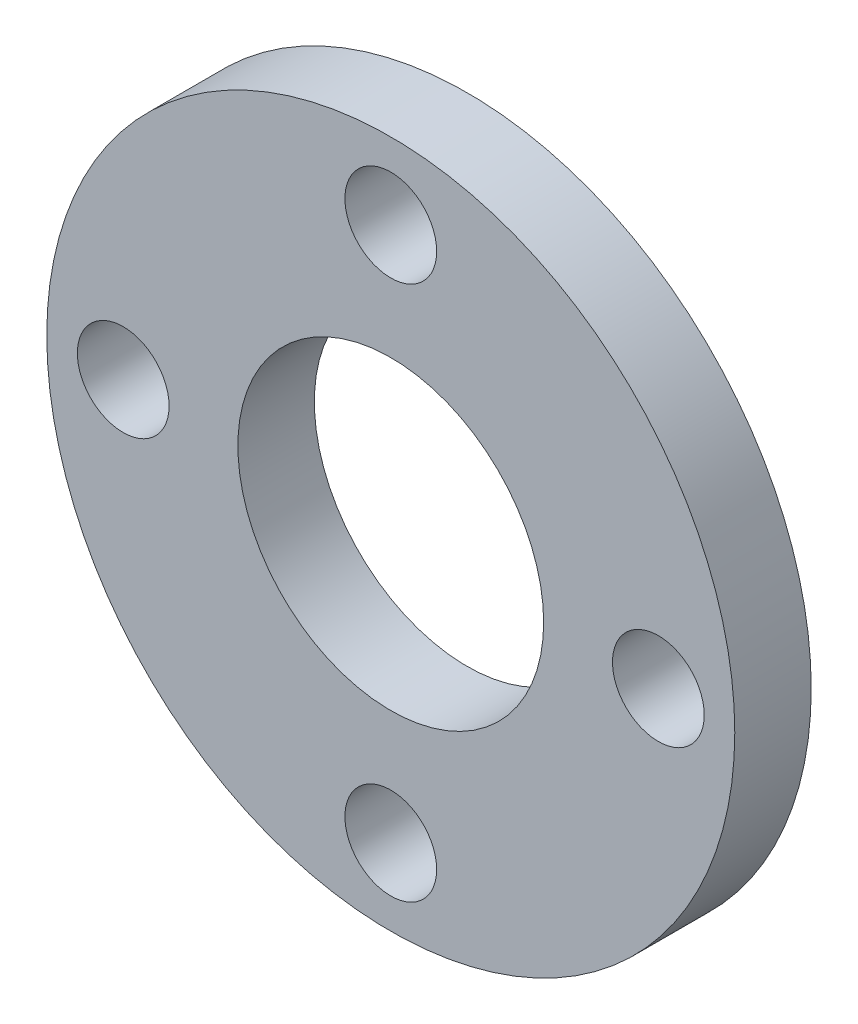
from build123d import *

# Parameters (mm, degrees)
SKETCH1_R           = 22.5
SKETCH1_R_2         = 10
SKETCH1_R_3         = 3
BOSS_EXTRUDE1_DEPTH = 5


with BuildPart() as part:
    # Sketch1 → Boss-Extrude1 (new body)
    with BuildSketch(Plane.XY):
        Circle(SKETCH1_R)
        Circle(SKETCH1_R_2, mode=Mode.SUBTRACT)
        with Locations((0, 17.506698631)):
            Circle(SKETCH1_R_3, mode=Mode.SUBTRACT)
        with Locations((17.5, 0)):
            Circle(SKETCH1_R_3, mode=Mode.SUBTRACT)
        with Locations((0, -17.5)):
            Circle(SKETCH1_R_3, mode=Mode.SUBTRACT)
        with Locations((-17.5, 0)):
            Circle(SKETCH1_R_3, mode=Mode.SUBTRACT)
    extrude(amount=BOSS_EXTRUDE1_DEPTH)


solid = part.part
